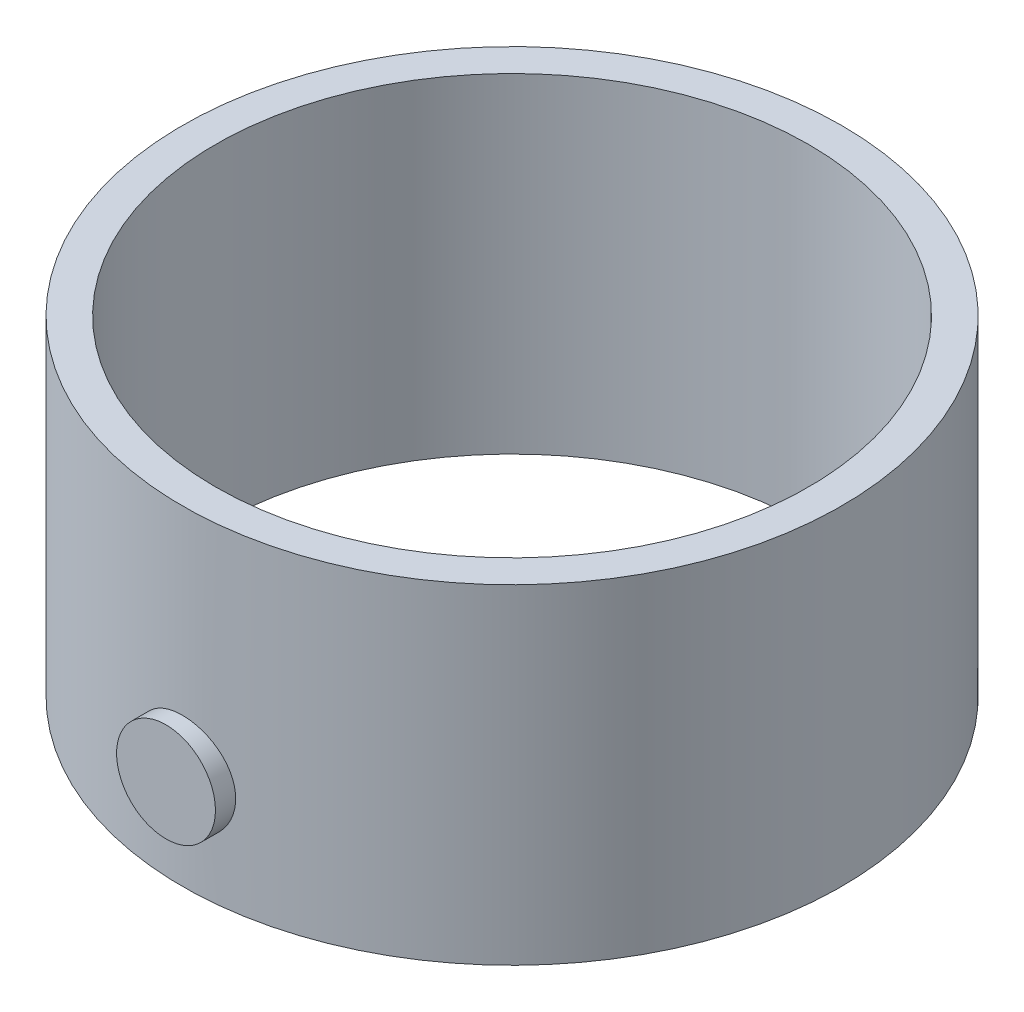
from build123d import *

# Parameters (mm, degrees)
SKETCH1_W                = 254
SKETCH1_H                = 254
SHELL1_T                 = -25.4
BOSS_EXTRUDE1_REACH      = 634.582
BOSS_EXTRUDE1_END_RADIUS = 254
SKETCH2_R                = 38.1


with BuildPart() as part:
    # Sketch1 → Revolve1 (revolve)
    with BuildSketch(Plane.XY, mode=Mode.PRIVATE) as revolve1_sk:
        with Locations((127, 127)):
            Rectangle(SKETCH1_W, SKETCH1_H)
    revolve(revolve1_sk.sketch.rotate(Axis((0, 0, 0), (0, 1, 0)), 90), axis=Axis((0, 0, 0), (0, 1, 0)))

    # Shell1
    shell1_openings = [part.faces().sort_by_distance(p)[0] for p in [
        (0, 0, 0),
        (0, 254, 0),
    ]]
    offset(amount=SHELL1_T, openings=shell1_openings, kind=Kind.INTERSECTION)

    # Boss-Extrude1: up to this cylinder (the profile starts outside it)
    boss_extrude1_end = Plane(origin=(0, 76.2, 0), z_dir=(0, -1, 0)) * Cylinder(BOSS_EXTRUDE1_END_RADIUS, 1778.164, mode=Mode.PRIVATE)
    # Sketch2 → Boss-Extrude1 (add, up to the surface)
    with BuildSketch(Plane.XY.offset(266.7), mode=Mode.PRIVATE) as boss_extrude1_sk1:
        with Locations((0, 76.2)):
            Circle(SKETCH2_R)
    boss_extrude1_tool1 = extrude(boss_extrude1_sk1.sketch, amount=-BOSS_EXTRUDE1_REACH, mode=Mode.PRIVATE) - boss_extrude1_end
    add(boss_extrude1_tool1.solids().sort_by_distance((0, 76.2, 266.7))[0])


solid = part.part
